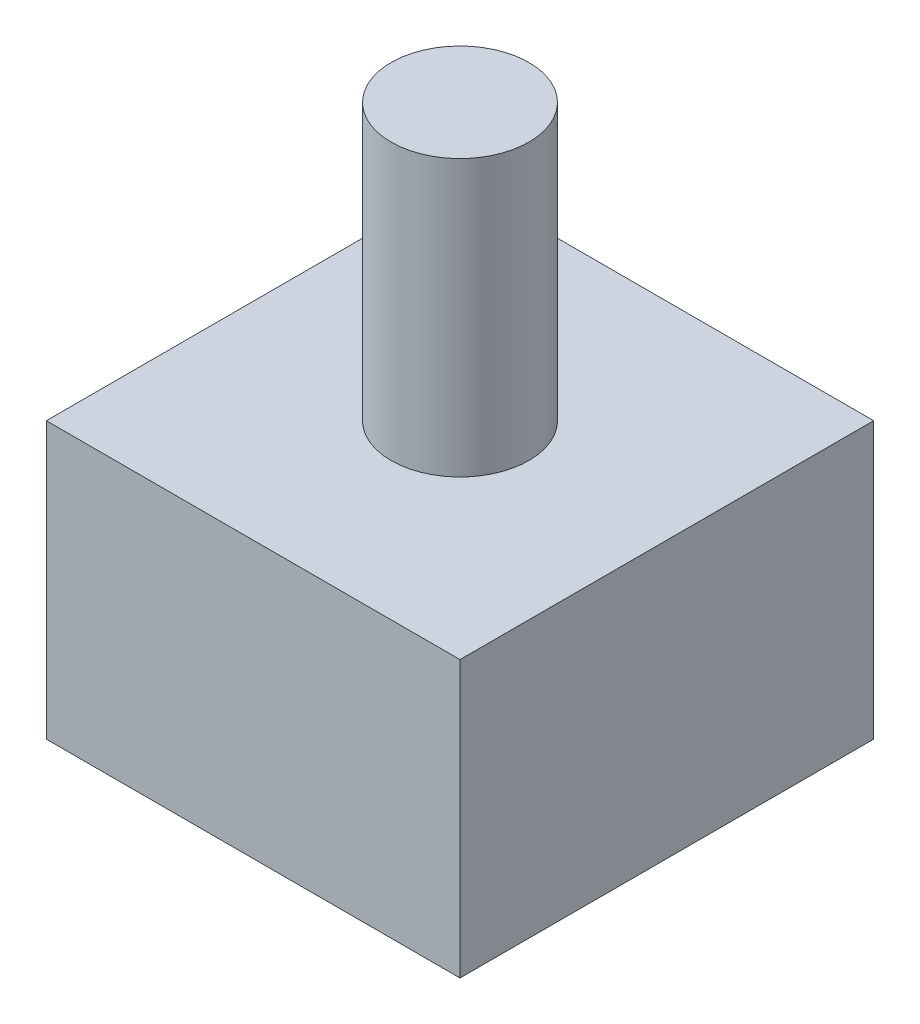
from build123d import *

# Parameters (mm, degrees)
SZKIC2_R                    = 2.5
DODANIE_WYCI_GNI_CIE1_DEPTH = 20
SZKIC2_3_W                  = 15
SZKIC2_3_H                  = 15
DODANIE_WYCI_GNI_CIE2_DEPTH = 10


with BuildPart() as part:
    # Szkic2 → Dodanie-wyci_gni_cie1 (new body)
    with BuildSketch(Plane(origin=(0, 0, 0), x_dir=(1, 0, 0), z_dir=(0, 1, 0))):
        with Locations(Location((0, 0, 0), (0, 0, 270))):
            Circle(SZKIC2_R)
    extrude(amount=DODANIE_WYCI_GNI_CIE1_DEPTH)

    # Szkic2_3 → Dodanie-wyci_gni_cie2 (add)
    with BuildSketch(Plane(origin=(0, 0, 0), x_dir=(1, 0, 0), z_dir=(0, 1, 0))):
        Rectangle(SZKIC2_3_W, SZKIC2_3_H)
    extrude(amount=DODANIE_WYCI_GNI_CIE2_DEPTH)


solid = part.part
